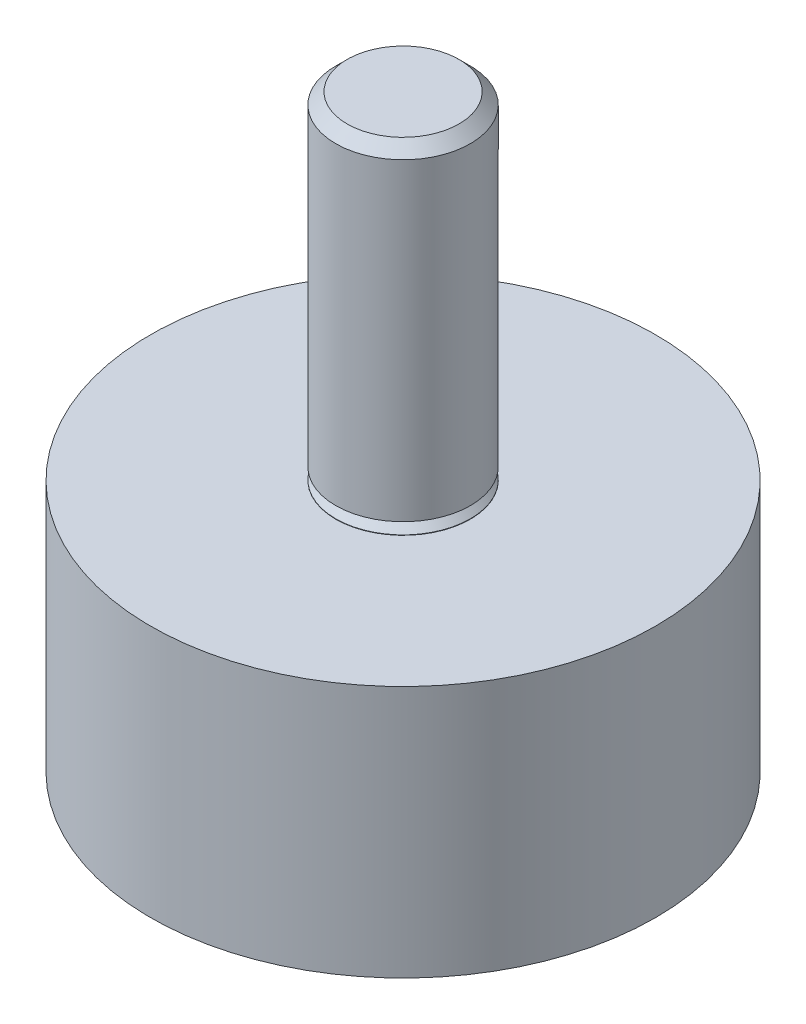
ISO-10303-21;
HEADER;
FILE_DESCRIPTION(('STEP AP214'),'2;1');
FILE_NAME('part.step','',(''),(''),'','','');
FILE_SCHEMA(('AUTOMOTIVE_DESIGN { 1 0 10303 214 1 1 1 1 }'));
ENDSEC;
DATA;
#1=APPLICATION_CONTEXT('core data for automotive mechanical design processes');
#2=APPLICATION_PROTOCOL_DEFINITION('international standard','automotive_design',2000,#1);
#3=PRODUCT_CONTEXT('',#1,'mechanical');
#4=PRODUCT('Part','Part','',(#3));
#5=PRODUCT_RELATED_PRODUCT_CATEGORY('part','',(#4));
#6=PRODUCT_DEFINITION_FORMATION('','',#4);
#7=PRODUCT_DEFINITION_CONTEXT('part definition',#1,'design');
#8=PRODUCT_DEFINITION('design','',#6,#7);
#9=PRODUCT_DEFINITION_SHAPE('','',#8);
#10=(LENGTH_UNIT() NAMED_UNIT(*) SI_UNIT(.MILLI.,.METRE.));
#11=(NAMED_UNIT(*) PLANE_ANGLE_UNIT() SI_UNIT($,.RADIAN.));
#12=(NAMED_UNIT(*) SI_UNIT($,.STERADIAN.) SOLID_ANGLE_UNIT());
#13=UNCERTAINTY_MEASURE_WITH_UNIT(LENGTH_MEASURE(1.E-05),#10,'distance_accuracy_value','');
#14=(GEOMETRIC_REPRESENTATION_CONTEXT(3) GLOBAL_UNCERTAINTY_ASSIGNED_CONTEXT((#13)) GLOBAL_UNIT_ASSIGNED_CONTEXT((#10,
#11,#12)) REPRESENTATION_CONTEXT('',''));
#15=CARTESIAN_POINT('',(0.,0.,0.));
#16=DIRECTION('',(0.,0.,1.));
#17=DIRECTION('',(1.,0.,0.));
#18=AXIS2_PLACEMENT_3D('',#15,#16,#17);
#19=CARTESIAN_POINT('',(3.3234375,35.,0.));
#20=DIRECTION('',(0.,-1.,0.));
#21=DIRECTION('',(0.,0.,-1.));
#22=AXIS2_PLACEMENT_3D('',#19,#20,#21);
#23=PLANE('',#22);
#24=CARTESIAN_POINT('',(0.,35.,0.));
#25=DIRECTION('',(0.,1.,0.));
#26=DIRECTION('',(0.,0.,1.));
#27=AXIS2_PLACEMENT_3D('',#24,#25,#26);
#28=CIRCLE('',#27,3.3234375);
#29=CARTESIAN_POINT('',(0.,35.,3.3234375));
#30=VERTEX_POINT('',#29);
#31=EDGE_CURVE('E22',#30,#30,#28,.T.);
#32=ORIENTED_EDGE('',*,*,#31,.T.);
#33=EDGE_LOOP('',(#32));
#34=FACE_BOUND('',#33,.T.);
#35=ADVANCED_FACE('F14',(#34),#23,.F.);
#36=CARTESIAN_POINT('',(0.,14.3234375,0.));
#37=DIRECTION('',(0.,1.,0.));
#38=DIRECTION('',(0.,0.,1.));
#39=AXIS2_PLACEMENT_3D('',#36,#37,#38);
#40=CYLINDRICAL_SURFACE('',#39,4.);
#41=CARTESIAN_POINT('',(0.,15.7,0.));
#42=DIRECTION('',(0.,-1.,0.));
#43=DIRECTION('',(0.,0.,-1.));
#44=AXIS2_PLACEMENT_3D('',#41,#42,#43);
#45=CIRCLE('',#44,4.);
#46=CARTESIAN_POINT('',(0.,15.7,-4.));
#47=VERTEX_POINT('',#46);
#48=EDGE_CURVE('E37',#47,#47,#45,.T.);
#49=ORIENTED_EDGE('',*,*,#48,.F.);
#50=EDGE_LOOP('',(#49));
#51=FACE_BOUND('',#50,.T.);
#52=CARTESIAN_POINT('',(0.,34.3234375,0.));
#53=DIRECTION('',(0.,1.,0.));
#54=DIRECTION('',(0.,0.,1.));
#55=AXIS2_PLACEMENT_3D('',#52,#53,#54);
#56=CIRCLE('',#55,4.);
#57=CARTESIAN_POINT('',(0.,34.3234375,4.));
#58=VERTEX_POINT('',#57);
#59=EDGE_CURVE('E10',#58,#58,#56,.T.);
#60=ORIENTED_EDGE('',*,*,#59,.F.);
#61=EDGE_LOOP('',(#60));
#62=FACE_BOUND('',#61,.T.);
#63=ADVANCED_FACE('F93',(#51,#62),#40,.T.);
#64=CARTESIAN_POINT('',(0.,34.3234375,0.));
#65=DIRECTION('',(0.,-1.,0.));
#66=DIRECTION('',(0.,0.,-1.));
#67=AXIS2_PLACEMENT_3D('',#64,#65,#66);
#68=CONICAL_SURFACE('',#67,4.,0.785398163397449);
#69=ORIENTED_EDGE('',*,*,#31,.F.);
#70=EDGE_LOOP('',(#69));
#71=FACE_BOUND('',#70,.T.);
#72=ORIENTED_EDGE('',*,*,#59,.T.);
#73=EDGE_LOOP('',(#72));
#74=FACE_BOUND('',#73,.T.);
#75=ADVANCED_FACE('F99',(#71,#74),#68,.T.);
#76=CARTESIAN_POINT('',(0.,15.7,0.));
#77=DIRECTION('',(0.,-1.,0.));
#78=DIRECTION('',(0.,0.,-1.));
#79=AXIS2_PLACEMENT_3D('',#76,#77,#78);
#80=CONICAL_SURFACE('',#79,3.3234375,0.785398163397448);
#81=CARTESIAN_POINT('',(0.,15.0234375,0.));
#82=DIRECTION('',(0.,-1.,0.));
#83=DIRECTION('',(0.,0.,-1.));
#84=AXIS2_PLACEMENT_3D('',#81,#82,#83);
#85=CIRCLE('',#84,4.);
#86=CARTESIAN_POINT('',(0.,15.0234375,-4.));
#87=VERTEX_POINT('',#86);
#88=EDGE_CURVE('E31',#87,#87,#85,.T.);
#89=ORIENTED_EDGE('',*,*,#88,.F.);
#90=EDGE_LOOP('',(#89));
#91=FACE_BOUND('',#90,.T.);
#92=CARTESIAN_POINT('',(0.,15.7,0.));
#93=DIRECTION('',(0.,-1.,0.));
#94=DIRECTION('',(0.,0.,-1.));
#95=AXIS2_PLACEMENT_3D('',#92,#93,#94);
#96=CIRCLE('',#95,3.3234375);
#97=CARTESIAN_POINT('',(0.,15.7,-3.3234375));
#98=VERTEX_POINT('',#97);
#99=EDGE_CURVE('E40',#98,#98,#96,.T.);
#100=ORIENTED_EDGE('',*,*,#99,.T.);
#101=EDGE_LOOP('',(#100));
#102=FACE_BOUND('',#101,.T.);
#103=ADVANCED_FACE('F105',(#91,#102),#80,.T.);
#104=CARTESIAN_POINT('',(4.,15.7,0.));
#105=DIRECTION('',(0.,1.,0.));
#106=DIRECTION('',(0.,0.,1.));
#107=AXIS2_PLACEMENT_3D('',#104,#105,#106);
#108=PLANE('',#107);
#109=ORIENTED_EDGE('',*,*,#99,.F.);
#110=EDGE_LOOP('',(#109));
#111=FACE_BOUND('',#110,.T.);
#112=ORIENTED_EDGE('',*,*,#48,.T.);
#113=EDGE_LOOP('',(#112));
#114=FACE_BOUND('',#113,.T.);
#115=ADVANCED_FACE('F111',(#111,#114),#108,.F.);
#116=CARTESIAN_POINT('',(0.,15.,0.));
#117=DIRECTION('',(0.,1.,0.));
#118=DIRECTION('',(0.,0.,1.));
#119=AXIS2_PLACEMENT_3D('',#116,#117,#118);
#120=CIRCLE('',#119,4.);
#121=CARTESIAN_POINT('',(0.,15.,4.));
#122=VERTEX_POINT('',#121);
#123=EDGE_CURVE('E17',#122,#122,#120,.T.);
#124=ORIENTED_EDGE('',*,*,#123,.T.);
#125=EDGE_LOOP('',(#124));
#126=FACE_BOUND('',#125,.T.);
#127=ORIENTED_EDGE('',*,*,#88,.T.);
#128=EDGE_LOOP('',(#127));
#129=FACE_BOUND('',#128,.T.);
#130=ADVANCED_FACE('F101',(#126,#129),#40,.T.);
#131=CARTESIAN_POINT('',(0.,15.,0.));
#132=DIRECTION('',(0.,1.,0.));
#133=DIRECTION('',(0.,0.,1.));
#134=AXIS2_PLACEMENT_3D('',#131,#132,#133);
#135=PLANE('',#134);
#136=CARTESIAN_POINT('',(0.,15.,0.));
#137=DIRECTION('',(0.,-1.,0.));
#138=DIRECTION('',(1.,0.,0.));
#139=AXIS2_PLACEMENT_3D('',#136,#137,#138);
#140=CIRCLE('',#139,15.);
#141=CARTESIAN_POINT('',(15.,15.,0.));
#142=VERTEX_POINT('',#141);
#143=EDGE_CURVE('E44',#142,#142,#140,.T.);
#144=ORIENTED_EDGE('',*,*,#143,.F.);
#145=EDGE_LOOP('',(#144));
#146=FACE_BOUND('',#145,.T.);
#147=ORIENTED_EDGE('',*,*,#123,.F.);
#148=EDGE_LOOP('',(#147));
#149=FACE_BOUND('',#148,.T.);
#150=ADVANCED_FACE('F122',(#146,#149),#135,.T.);
#151=CARTESIAN_POINT('',(0.,13.,0.));
#152=DIRECTION('',(0.,1.,0.));
#153=DIRECTION('',(1.,0.,0.));
#154=AXIS2_PLACEMENT_3D('',#151,#152,#153);
#155=CYLINDRICAL_SURFACE('',#154,15.);
#156=ORIENTED_EDGE('',*,*,#143,.T.);
#157=EDGE_LOOP('',(#156));
#158=FACE_BOUND('',#157,.T.);
#159=CARTESIAN_POINT('',(0.,0.,0.));
#160=DIRECTION('',(0.,1.,0.));
#161=DIRECTION('',(1.,0.,0.));
#162=AXIS2_PLACEMENT_3D('',#159,#160,#161);
#163=CIRCLE('',#162,15.);
#164=CARTESIAN_POINT('',(15.,0.,0.));
#165=VERTEX_POINT('',#164);
#166=EDGE_CURVE('E48',#165,#165,#163,.T.);
#167=ORIENTED_EDGE('',*,*,#166,.T.);
#168=EDGE_LOOP('',(#167));
#169=FACE_BOUND('',#168,.T.);
#170=ADVANCED_FACE('F118',(#158,#169),#155,.T.);
#171=CARTESIAN_POINT('',(0.,0.,0.));
#172=DIRECTION('',(0.,-1.,0.));
#173=DIRECTION('',(0.,0.,-1.));
#174=AXIS2_PLACEMENT_3D('',#171,#172,#173);
#175=PLANE('',#174);
#176=ORIENTED_EDGE('',*,*,#166,.F.);
#177=EDGE_LOOP('',(#176));
#178=FACE_BOUND('',#177,.T.);
#179=CARTESIAN_POINT('',(0.,0.,0.));
#180=DIRECTION('',(0.,-1.,0.));
#181=DIRECTION('',(0.,0.,-1.));
#182=AXIS2_PLACEMENT_3D('',#179,#180,#181);
#183=CIRCLE('',#182,4.);
#184=CARTESIAN_POINT('',(0.,0.,-4.));
#185=VERTEX_POINT('',#184);
#186=EDGE_CURVE('E60',#185,#185,#183,.T.);
#187=ORIENTED_EDGE('',*,*,#186,.F.);
#188=EDGE_LOOP('',(#187));
#189=FACE_BOUND('',#188,.T.);
#190=ADVANCED_FACE('F121',(#178,#189),#175,.T.);
#191=CARTESIAN_POINT('',(4.,6.33,0.));
#192=DIRECTION('',(0.,1.,0.));
#193=DIRECTION('',(0.,0.,1.));
#194=AXIS2_PLACEMENT_3D('',#191,#192,#193);
#195=PLANE('',#194);
#196=CARTESIAN_POINT('',(0.,6.33,0.));
#197=DIRECTION('',(0.,-1.,0.));
#198=DIRECTION('',(0.,0.,-1.));
#199=AXIS2_PLACEMENT_3D('',#196,#197,#198);
#200=CIRCLE('',#199,3.3234375);
#201=CARTESIAN_POINT('',(0.,6.33,-3.3234375));
#202=VERTEX_POINT('',#201);
#203=EDGE_CURVE('E52',#202,#202,#200,.T.);
#204=ORIENTED_EDGE('',*,*,#203,.T.);
#205=EDGE_LOOP('',(#204));
#206=FACE_BOUND('',#205,.T.);
#207=CARTESIAN_POINT('',(0.,6.33,0.));
#208=DIRECTION('',(0.,1.,0.));
#209=DIRECTION('',(1.,0.,0.));
#210=AXIS2_PLACEMENT_3D('',#207,#208,#209);
#211=CIRCLE('',#210,4.8);
#212=CARTESIAN_POINT('',(4.8,6.33,0.));
#213=VERTEX_POINT('',#212);
#214=EDGE_CURVE('E68',#213,#213,#211,.T.);
#215=ORIENTED_EDGE('',*,*,#214,.T.);
#216=EDGE_LOOP('',(#215));
#217=FACE_BOUND('',#216,.T.);
#218=ADVANCED_FACE('F75',(#206,#217),#195,.T.);
#219=CARTESIAN_POINT('',(0.,-1.,0.));
#220=DIRECTION('',(0.,-1.,0.));
#221=DIRECTION('',(0.,0.,-1.));
#222=AXIS2_PLACEMENT_3D('',#219,#220,#221);
#223=CYLINDRICAL_SURFACE('',#222,3.3234375);
#224=CARTESIAN_POINT('',(0.,0.6765625,0.));
#225=DIRECTION('',(0.,-1.,0.));
#226=DIRECTION('',(0.,0.,-1.));
#227=AXIS2_PLACEMENT_3D('',#224,#225,#226);
#228=CIRCLE('',#227,3.3234375);
#229=CARTESIAN_POINT('',(0.,0.6765625,-3.3234375));
#230=VERTEX_POINT('',#229);
#231=EDGE_CURVE('E56',#230,#230,#228,.T.);
#232=ORIENTED_EDGE('',*,*,#231,.T.);
#233=EDGE_LOOP('',(#232));
#234=FACE_BOUND('',#233,.T.);
#235=ORIENTED_EDGE('',*,*,#203,.F.);
#236=EDGE_LOOP('',(#235));
#237=FACE_BOUND('',#236,.T.);
#238=ADVANCED_FACE('F132',(#234,#237),#223,.F.);
#239=CARTESIAN_POINT('',(0.,0.6765625,0.));
#240=DIRECTION('',(0.,-1.,0.));
#241=DIRECTION('',(0.,0.,-1.));
#242=AXIS2_PLACEMENT_3D('',#239,#240,#241);
#243=CONICAL_SURFACE('',#242,3.3234375,0.785398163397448);
#244=ORIENTED_EDGE('',*,*,#186,.T.);
#245=EDGE_LOOP('',(#244));
#246=FACE_BOUND('',#245,.T.);
#247=ORIENTED_EDGE('',*,*,#231,.F.);
#248=EDGE_LOOP('',(#247));
#249=FACE_BOUND('',#248,.T.);
#250=ADVANCED_FACE('F87',(#246,#249),#243,.F.);
#251=CARTESIAN_POINT('',(0.,7.93,0.));
#252=DIRECTION('',(0.,1.,0.));
#253=DIRECTION('',(0.,0.,1.));
#254=AXIS2_PLACEMENT_3D('',#251,#252,#253);
#255=PLANE('',#254);
#256=CARTESIAN_POINT('',(0.,7.93,0.));
#257=DIRECTION('',(0.,-1.,0.));
#258=DIRECTION('',(1.,0.,0.));
#259=AXIS2_PLACEMENT_3D('',#256,#257,#258);
#260=CIRCLE('',#259,4.8);
#261=CARTESIAN_POINT('',(4.8,7.93,0.));
#262=VERTEX_POINT('',#261);
#263=EDGE_CURVE('E64',#262,#262,#260,.T.);
#264=ORIENTED_EDGE('',*,*,#263,.T.);
#265=EDGE_LOOP('',(#264));
#266=FACE_BOUND('',#265,.T.);
#267=ADVANCED_FACE('F79',(#266),#255,.F.);
#268=CARTESIAN_POINT('',(0.,6.33,0.));
#269=DIRECTION('',(0.,1.,0.));
#270=DIRECTION('',(1.,0.,0.));
#271=AXIS2_PLACEMENT_3D('',#268,#269,#270);
#272=CYLINDRICAL_SURFACE('',#271,4.8);
#273=ORIENTED_EDGE('',*,*,#263,.F.);
#274=EDGE_LOOP('',(#273));
#275=FACE_BOUND('',#274,.T.);
#276=ORIENTED_EDGE('',*,*,#214,.F.);
#277=EDGE_LOOP('',(#276));
#278=FACE_BOUND('',#277,.T.);
#279=ADVANCED_FACE('F77',(#275,#278),#272,.F.);
#280=CLOSED_SHELL('',(#35,#63,#75,#103,#115,#130,#150,#170,#190,#218,#238,#250,#267,#279));
#281=MANIFOLD_SOLID_BREP('B1',#280);
#282=ADVANCED_BREP_SHAPE_REPRESENTATION('',(#18,#281),#14);
#283=SHAPE_DEFINITION_REPRESENTATION(#9,#282);
ENDSEC;
END-ISO-10303-21;
